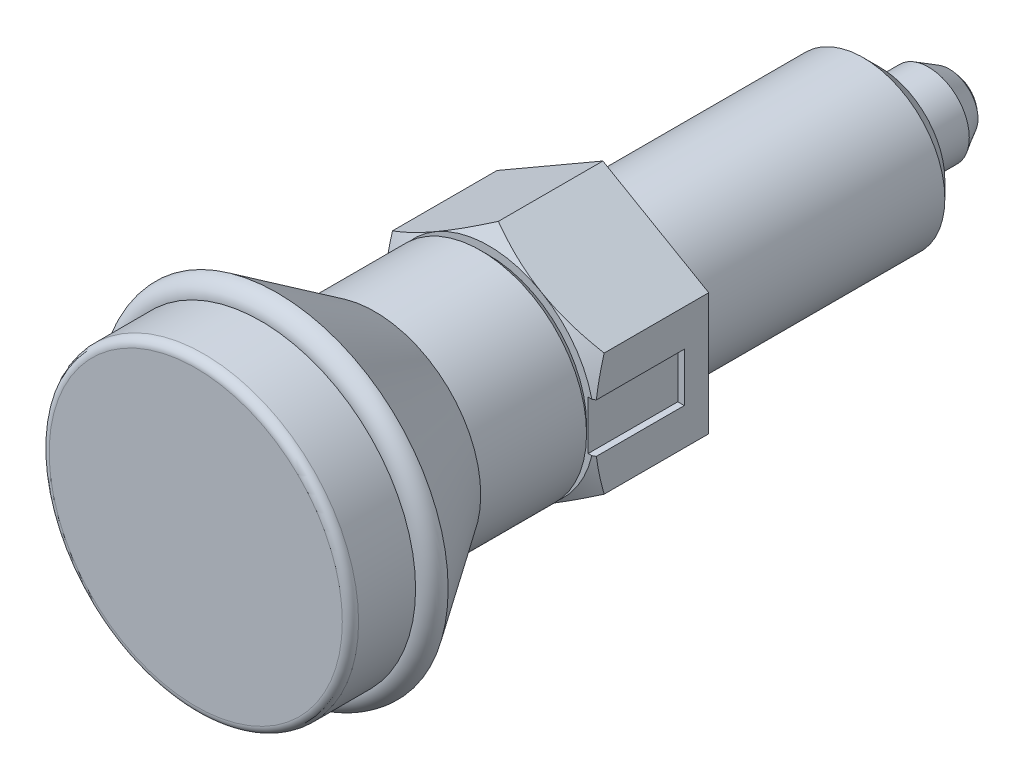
ISO-10303-21;
HEADER;
FILE_DESCRIPTION(('STEP AP214'),'2;1');
FILE_NAME('part.step','',(''),(''),'','','');
FILE_SCHEMA(('AUTOMOTIVE_DESIGN { 1 0 10303 214 1 1 1 1 }'));
ENDSEC;
DATA;
#1=APPLICATION_CONTEXT('core data for automotive mechanical design processes');
#2=APPLICATION_PROTOCOL_DEFINITION('international standard','automotive_design',2000,#1);
#3=PRODUCT_CONTEXT('',#1,'mechanical');
#4=PRODUCT('Part','Part','',(#3));
#5=PRODUCT_RELATED_PRODUCT_CATEGORY('part','',(#4));
#6=PRODUCT_DEFINITION_FORMATION('','',#4);
#7=PRODUCT_DEFINITION_CONTEXT('part definition',#1,'design');
#8=PRODUCT_DEFINITION('design','',#6,#7);
#9=PRODUCT_DEFINITION_SHAPE('','',#8);
#10=(LENGTH_UNIT() NAMED_UNIT(*) SI_UNIT(.MILLI.,.METRE.));
#11=(NAMED_UNIT(*) PLANE_ANGLE_UNIT() SI_UNIT($,.RADIAN.));
#12=(NAMED_UNIT(*) SI_UNIT($,.STERADIAN.) SOLID_ANGLE_UNIT());
#13=UNCERTAINTY_MEASURE_WITH_UNIT(LENGTH_MEASURE(1.E-05),#10,'distance_accuracy_value','');
#14=(GEOMETRIC_REPRESENTATION_CONTEXT(3) GLOBAL_UNCERTAINTY_ASSIGNED_CONTEXT((#13)) GLOBAL_UNIT_ASSIGNED_CONTEXT((#10,
#11,#12)) REPRESENTATION_CONTEXT('',''));
#15=CARTESIAN_POINT('',(0.,0.,0.));
#16=DIRECTION('',(0.,0.,1.));
#17=DIRECTION('',(1.,0.,0.));
#18=AXIS2_PLACEMENT_3D('',#15,#16,#17);
#19=CARTESIAN_POINT('',(2.59480249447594E-10,-1.4980960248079E-10,7.));
#20=DIRECTION('',(-3.7068607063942E-11,2.14013717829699E-11,-1.));
#21=DIRECTION('',(-1.,0.,3.7068607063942E-11));
#22=AXIS2_PLACEMENT_3D('',#19,#20,#21);
#23=CONICAL_SURFACE('',#22,6.49999999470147,1.0471975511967);
#24=CARTESIAN_POINT('',(6.50000000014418,-9.95291698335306,3.8895764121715));
#25=CARTESIAN_POINT('',(6.50000000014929,-9.66753022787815,4.02749105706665));
#26=CARTESIAN_POINT('',(6.50000000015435,-9.38146872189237,4.16403471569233));
#27=CARTESIAN_POINT('',(6.50000000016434,-8.80763137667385,4.43359663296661));
#28=CARTESIAN_POINT('',(6.50000000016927,-8.51985525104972,4.56661428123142));
#29=CARTESIAN_POINT('',(6.500000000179,-7.94066929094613,4.82904149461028));
#30=CARTESIAN_POINT('',(6.5000000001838,-7.64924808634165,4.95842605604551));
#31=CARTESIAN_POINT('',(6.50000000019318,-7.06401043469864,5.21163779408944));
#32=CARTESIAN_POINT('',(6.50000000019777,-6.77019411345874,5.33546526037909));
#33=CARTESIAN_POINT('',(6.50000000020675,-6.17605150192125,5.57755519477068));
#34=CARTESIAN_POINT('',(6.50000000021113,-5.87568957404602,5.69573067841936));
#35=CARTESIAN_POINT('',(6.50000000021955,-5.27142269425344,5.92282610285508));
#36=CARTESIAN_POINT('',(6.50000000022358,-4.96751735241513,6.03174501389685));
#37=CARTESIAN_POINT('',(6.50000000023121,-4.35630541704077,6.23740097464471));
#38=CARTESIAN_POINT('',(6.5000000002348,-4.04900762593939,6.33416392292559));
#39=CARTESIAN_POINT('',(6.5000000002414,-3.4300402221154,6.51236428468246));
#40=CARTESIAN_POINT('',(6.50000000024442,-3.11837202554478,6.59380654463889));
#41=CARTESIAN_POINT('',(6.50000000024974,-2.49046594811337,6.73741591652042));
#42=CARTESIAN_POINT('',(6.50000000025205,-2.17422687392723,6.79957789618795));
#43=CARTESIAN_POINT('',(6.50000000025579,-1.53789167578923,6.90042577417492));
#44=CARTESIAN_POINT('',(6.50000000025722,-1.21779554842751,6.93911165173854));
#45=CARTESIAN_POINT('',(6.50000000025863,-0.737141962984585,6.9770534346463));
#46=CARTESIAN_POINT('',(6.50000000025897,-0.577336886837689,6.98635478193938));
#47=CARTESIAN_POINT('',(6.50000000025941,-0.25746890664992,6.99818590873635));
#48=CARTESIAN_POINT('',(6.5000000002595,-0.0974060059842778,7.00071577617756));
#49=CARTESIAN_POINT('',(6.50000000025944,0.222635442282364,6.99893598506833));
#50=CARTESIAN_POINT('',(6.50000000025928,0.382614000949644,6.99462824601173));
#51=CARTESIAN_POINT('',(6.50000000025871,0.702250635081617,6.97928241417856));
#52=CARTESIAN_POINT('',(6.5000000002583,0.861908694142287,6.96824398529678));
#53=CARTESIAN_POINT('',(6.50000000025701,1.24887053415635,6.93356312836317));
#54=CARTESIAN_POINT('',(6.50000000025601,1.47587694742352,6.90654811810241));
#55=CARTESIAN_POINT('',(6.50000000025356,1.92815030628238,6.84041010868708));
#56=CARTESIAN_POINT('',(6.50000000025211,2.15341675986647,6.80128380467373));
#57=CARTESIAN_POINT('',(6.50000000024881,2.60202427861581,6.7123108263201));
#58=CARTESIAN_POINT('',(6.50000000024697,2.82536331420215,6.66245401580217));
#59=CARTESIAN_POINT('',(6.50000000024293,3.26974354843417,6.55354123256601));
#60=CARTESIAN_POINT('',(6.50000000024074,3.49078496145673,6.49448612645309));
#61=CARTESIAN_POINT('',(6.50000000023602,3.93601414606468,6.36704588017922));
#62=CARTESIAN_POINT('',(6.50000000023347,4.1601462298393,6.29846752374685));
#63=CARTESIAN_POINT('',(6.50000000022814,4.60604131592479,6.15453487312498));
#64=CARTESIAN_POINT('',(6.50000000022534,4.82780583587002,6.07918525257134));
#65=CARTESIAN_POINT('',(6.50000000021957,5.26807593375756,5.92326649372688));
#66=CARTESIAN_POINT('',(6.50000000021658,5.48659282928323,5.84272912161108));
#67=CARTESIAN_POINT('',(6.50000000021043,5.92193123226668,5.67692729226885));
#68=CARTESIAN_POINT('',(6.50000000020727,6.13875201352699,5.59166092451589));
#69=CARTESIAN_POINT('',(6.50000000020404,6.3547851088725,5.50449786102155));
#70=B_SPLINE_CURVE_WITH_KNOTS('',3,(#24,#25,#26,#27,#28,#29,#30,#31,#32,#33,#34,#35,#36,#37,#38,
#39,#40,#41,#42,#43,#44,#45,#46,#47,#48,#49,#50,#51,#52,#53,#54,#55,#56,#57,#58,#59,#60,#61,#62,
#63,#64,#65,#66,#67,#68,#69),.UNSPECIFIED.,.F.,.F.,(4,2,2,2,2,2,2,2,2,2,2,2,2,2,2,2,2,2,2,2,2,2,
4),(0.,0.950904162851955,1.90197187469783,2.85848216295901,3.81494253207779,4.78314526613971,
5.75145556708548,6.71766655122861,7.68357137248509,8.6497330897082,9.61589566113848,
10.0960003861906,10.5760988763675,11.0560626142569,11.5360503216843,12.221493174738,
12.9071232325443,13.5934038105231,14.2796197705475,14.9826563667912,15.6852113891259,
16.3838119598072,17.0826968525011),.UNSPECIFIED.);
#71=CARTESIAN_POINT('',(6.50000000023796,-3.75277674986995,6.41944341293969));
#72=VERTEX_POINT('',#71);
#73=CARTESIAN_POINT('',(6.50000000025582,-1.5000000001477,6.90137007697));
#74=VERTEX_POINT('',#73);
#75=EDGE_CURVE('E302',#72,#74,#70,.T.);
#76=ORIENTED_EDGE('',*,*,#75,.T.);
#77=CARTESIAN_POINT('',(7.59395940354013,-1.50000000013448,6.28368961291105));
#78=CARTESIAN_POINT('',(7.39727569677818,-1.50000000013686,6.39508777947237));
#79=CARTESIAN_POINT('',(7.20052625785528,-1.50000000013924,6.50637013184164));
#80=CARTESIAN_POINT('',(6.80685119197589,-1.500000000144,6.72862064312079));
#81=CARTESIAN_POINT('',(6.60992556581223,-1.50000000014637,6.83958880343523));
#82=CARTESIAN_POINT('',(6.21585121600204,-1.50000000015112,7.06112960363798));
#83=CARTESIAN_POINT('',(6.01870249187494,-1.50000000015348,7.17170224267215));
#84=CARTESIAN_POINT('',(5.62410400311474,-1.5000000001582,7.39231100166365));
#85=CARTESIAN_POINT('',(5.42665423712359,-1.50000000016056,7.50234711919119));
#86=CARTESIAN_POINT('',(5.22901565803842,-1.50000000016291,7.61204409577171));
#87=B_SPLINE_CURVE_WITH_KNOTS('',3,(#77,#78,#79,#80,#81,#82,#83,#84,#85,#86),.UNSPECIFIED.,.F.,
.F.,(4,2,2,2,4),(0.,0.678119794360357,1.35623655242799,2.0343547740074,2.71247606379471),.UNSPECIFIED.);
#88=CARTESIAN_POINT('',(6.32455531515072,-1.50000000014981,6.99999999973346));
#89=VERTEX_POINT('',#88);
#90=EDGE_CURVE('E146',#74,#89,#87,.T.);
#91=ORIENTED_EDGE('',*,*,#90,.T.);
#92=CARTESIAN_POINT('',(2.59480249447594E-10,-1.4980960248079E-10,7.));
#93=DIRECTION('',(3.7068607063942E-11,-2.14013717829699E-11,1.));
#94=DIRECTION('',(1.,0.,-3.7068607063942E-11));
#95=AXIS2_PLACEMENT_3D('',#92,#93,#94);
#96=CIRCLE('',#95,6.49999999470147);
#97=CARTESIAN_POINT('',(3.25000000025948,-5.62916512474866,6.99999999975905));
#98=VERTEX_POINT('',#97);
#99=EDGE_CURVE('E408',#98,#89,#96,.T.);
#100=ORIENTED_EDGE('',*,*,#99,.F.);
#101=CARTESIAN_POINT('',(-0.000199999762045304,-7.50566896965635,6.41937674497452));
#102=CARTESIAN_POINT('',(0.142677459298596,-7.4231786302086,6.46699557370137));
#103=CARTESIAN_POINT('',(0.28608763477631,-7.34038072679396,6.5124532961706));
#104=CARTESIAN_POINT('',(0.574072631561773,-7.17411251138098,6.59845131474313));
#105=CARTESIAN_POINT('',(0.718647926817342,-7.09064192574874,6.63898948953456));
#106=CARTESIAN_POINT('',(1.1546886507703,-6.83889369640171,6.75242899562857));
#107=CARTESIAN_POINT('',(1.44787528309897,-6.66962231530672,6.81695218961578));
#108=CARTESIAN_POINT('',(1.88662374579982,-6.41631077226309,6.89261341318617));
#109=CARTESIAN_POINT('',(2.03087463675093,-6.33302748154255,6.9141671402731));
#110=CARTESIAN_POINT('',(2.32002821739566,-6.16608458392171,6.95030968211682));
#111=CARTESIAN_POINT('',(2.464930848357,-6.08242501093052,6.96489911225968));
#112=CARTESIAN_POINT('',(2.75498777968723,-5.91496056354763,6.98674124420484));
#113=CARTESIAN_POINT('',(2.90014160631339,-5.83115596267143,6.99400227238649));
#114=CARTESIAN_POINT('',(3.19057533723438,-5.66347396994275,7.00103969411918));
#115=CARTESIAN_POINT('',(3.33585523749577,-5.57959658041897,7.0008163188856));
#116=CARTESIAN_POINT('',(3.73387594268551,-5.34979921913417,6.9899165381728));
#117=CARTESIAN_POINT('',(3.98648646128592,-5.20395446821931,6.97161817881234));
#118=CARTESIAN_POINT('',(4.4900296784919,-4.91323365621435,6.91359365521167));
#119=CARTESIAN_POINT('',(4.74096060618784,-4.7683586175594,6.8738476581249));
#120=CARTESIAN_POINT('',(5.24551722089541,-4.47705272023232,6.77449409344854));
#121=CARTESIAN_POINT('',(5.49907924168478,-4.33065861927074,6.71446557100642));
#122=CARTESIAN_POINT('',(6.00242193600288,-4.04005357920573,6.57822500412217));
#123=CARTESIAN_POINT('',(6.25220905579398,-3.89583891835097,6.50204496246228));
#124=CARTESIAN_POINT('',(6.50020000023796,-3.75266127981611,6.41937674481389));
#125=B_SPLINE_CURVE_WITH_KNOTS('',3,(#101,#102,#103,#104,#105,#106,#107,#108,#109,#110,#111,
#112,#113,#114,#115,#116,#117,#118,#119,#120,#121,#122,#123,#124),.UNSPECIFIED.,.F.,.F.,(4,2,2,
2,2,2,2,2,2,2,2,4),(0.,0.51510505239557,1.03043143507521,2.06322554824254,2.56697389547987,
3.07067772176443,3.57380860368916,4.07692394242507,4.9527935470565,5.82947446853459,
6.7255991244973,7.61996451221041),.UNSPECIFIED.);
#126=EDGE_CURVE('E294',#98,#72,#125,.T.);
#127=ORIENTED_EDGE('',*,*,#126,.T.);
#128=EDGE_LOOP('',(#76,#91,#100,#127));
#129=FACE_BOUND('',#128,.T.);
#130=ADVANCED_FACE('F14',(#129),#23,.T.);
#131=CARTESIAN_POINT('',(6.32455531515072,1.49999999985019,6.99999999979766));
#132=VERTEX_POINT('',#131);
#133=CARTESIAN_POINT('',(3.25000000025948,5.62916512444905,7.));
#134=VERTEX_POINT('',#133);
#135=EDGE_CURVE('E411',#132,#134,#96,.T.);
#136=ORIENTED_EDGE('',*,*,#135,.F.);
#137=CARTESIAN_POINT('',(5.22901565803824,1.49999999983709,7.61204409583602));
#138=CARTESIAN_POINT('',(5.4266542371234,1.49999999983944,7.50234711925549));
#139=CARTESIAN_POINT('',(5.62410400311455,1.49999999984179,7.39231100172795));
#140=CARTESIAN_POINT('',(6.01870249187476,1.49999999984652,7.17170224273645));
#141=CARTESIAN_POINT('',(6.21585121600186,1.49999999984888,7.06112960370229));
#142=CARTESIAN_POINT('',(6.60992556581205,1.49999999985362,6.83958880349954));
#143=CARTESIAN_POINT('',(6.80685119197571,1.499999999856,6.7286206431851));
#144=CARTESIAN_POINT('',(7.2005262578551,1.49999999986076,6.50637013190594));
#145=CARTESIAN_POINT('',(7.397275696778,1.49999999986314,6.39508777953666));
#146=CARTESIAN_POINT('',(7.59395940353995,1.49999999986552,6.28368961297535));
#147=B_SPLINE_CURVE_WITH_KNOTS('',3,(#137,#138,#139,#140,#141,#142,#143,#144,#145,#146),
.UNSPECIFIED.,.F.,.F.,(4,2,2,2,4),(0.,0.678121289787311,1.35623951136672,2.03435626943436,
2.71247606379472),.UNSPECIFIED.);
#148=CARTESIAN_POINT('',(6.50000000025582,1.4999999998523,6.90137007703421));
#149=VERTEX_POINT('',#148);
#150=EDGE_CURVE('E154',#132,#149,#147,.T.);
#151=ORIENTED_EDGE('',*,*,#150,.T.);
#152=CARTESIAN_POINT('',(6.50000000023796,3.75277674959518,6.41944341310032));
#153=VERTEX_POINT('',#152);
#154=EDGE_CURVE('E270',#149,#153,#70,.T.);
#155=ORIENTED_EDGE('',*,*,#154,.T.);
#156=CARTESIAN_POINT('',(6.50020000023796,3.75266127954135,6.41937674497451));
#157=CARTESIAN_POINT('',(6.35732254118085,3.83515161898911,6.46699557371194));
#158=CARTESIAN_POINT('',(6.21391236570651,3.91794952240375,6.5124532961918));
#159=CARTESIAN_POINT('',(5.92592736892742,4.08421773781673,6.59845131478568));
#160=CARTESIAN_POINT('',(5.78135207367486,4.16768832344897,6.63898948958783));
#161=CARTESIAN_POINT('',(5.3453113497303,4.41943655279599,6.75242899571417));
#162=CARTESIAN_POINT('',(5.05212471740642,4.58870793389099,6.81695218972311));
#163=CARTESIAN_POINT('',(4.61337625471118,4.84201947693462,6.89261341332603));
#164=CARTESIAN_POINT('',(4.46912536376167,4.92530276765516,6.91416714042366));
#165=CARTESIAN_POINT('',(4.17997178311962,5.09224566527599,6.95030968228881));
#166=CARTESIAN_POINT('',(4.03506915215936,5.17590523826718,6.96489911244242));
#167=CARTESIAN_POINT('',(3.74501222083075,5.34336968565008,6.98674124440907));
#168=CARTESIAN_POINT('',(3.59985839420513,5.42717428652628,6.99400227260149));
#169=CARTESIAN_POINT('',(3.30942466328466,5.59485627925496,7.00103969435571));
#170=CARTESIAN_POINT('',(3.16414476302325,5.67873366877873,7.00081631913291));
#171=CARTESIAN_POINT('',(2.7661240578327,5.90853103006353,6.98991653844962));
#172=CARTESIAN_POINT('',(2.51351353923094,6.05437578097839,6.97161817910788));
#173=CARTESIAN_POINT('',(2.00997032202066,6.34509659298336,6.91359365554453));
#174=CARTESIAN_POINT('',(1.75903939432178,6.48997163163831,6.87384765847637));
#175=CARTESIAN_POINT('',(1.25448277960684,6.78127752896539,6.77449409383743));
#176=CARTESIAN_POINT('',(1.00092075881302,6.92767162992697,6.7144655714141));
#177=CARTESIAN_POINT('',(0.497578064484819,7.21827666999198,6.57822500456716));
#178=CARTESIAN_POINT('',(0.247790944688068,7.36249133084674,6.5020449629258));
#179=CARTESIAN_POINT('',(-0.000199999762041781,7.5056689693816,6.41937674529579));
#180=B_SPLINE_CURVE_WITH_KNOTS('',3,(#156,#157,#158,#159,#160,#161,#162,#163,#164,#165,#166,
#167,#168,#169,#170,#171,#172,#173,#174,#175,#176,#177,#178,#179),.UNSPECIFIED.,.F.,.F.,(4,2,2,
2,2,2,2,2,2,2,2,4),(0.,0.515105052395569,1.03043143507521,2.06322554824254,2.56697389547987,
3.07067772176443,3.57380860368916,4.07692394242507,4.95279354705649,5.82947446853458,
6.7255991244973,7.61996451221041),.UNSPECIFIED.);
#181=EDGE_CURVE('E269',#153,#134,#180,.T.);
#182=ORIENTED_EDGE('',*,*,#181,.T.);
#183=EDGE_LOOP('',(#136,#151,#155,#182));
#184=FACE_BOUND('',#183,.T.);
#185=ADVANCED_FACE('F372',(#184),#23,.T.);
#186=CARTESIAN_POINT('',(2.59480249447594E-10,6.49999999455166,7.00000000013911));
#187=DIRECTION('',(3.7068607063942E-11,-2.14013717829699E-11,1.));
#188=DIRECTION('',(1.,0.,-3.7068607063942E-11));
#189=AXIS2_PLACEMENT_3D('',#186,#187,#188);
#190=PLANE('',#189);
#191=CARTESIAN_POINT('',(2.59480249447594E-10,-1.4980960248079E-10,7.));
#192=DIRECTION('',(3.7068607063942E-11,-2.14013717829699E-11,1.));
#193=DIRECTION('',(1.,0.,-3.7068607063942E-11));
#194=AXIS2_PLACEMENT_3D('',#191,#192,#193);
#195=CIRCLE('',#194,6.);
#196=CARTESIAN_POINT('',(6.00000000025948,-1.4980960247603E-10,6.99999999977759));
#197=VERTEX_POINT('',#196);
#198=EDGE_CURVE('E421',#197,#197,#195,.T.);
#199=ORIENTED_EDGE('',*,*,#198,.F.);
#200=EDGE_LOOP('',(#199));
#201=FACE_BOUND('',#200,.T.);
#202=ORIENTED_EDGE('',*,*,#99,.T.);
#203=DIRECTION('',(1.,0.,-3.7068607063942E-11));
#204=VECTOR('',#203,1.);
#205=CARTESIAN_POINT('',(6.10000000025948,-1.50000000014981,6.99999999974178));
#206=LINE('',#205,#204);
#207=CARTESIAN_POINT('',(6.10000000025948,-1.50000000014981,6.99999999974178));
#208=VERTEX_POINT('',#207);
#209=EDGE_CURVE('E155',#208,#89,#206,.T.);
#210=ORIENTED_EDGE('',*,*,#209,.F.);
#211=DIRECTION('',(0.,1.,2.14013717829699E-11));
#212=VECTOR('',#211,1.);
#213=CARTESIAN_POINT('',(6.10000000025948,-1.50000000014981,6.99999999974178));
#214=LINE('',#213,#212);
#215=CARTESIAN_POINT('',(6.10000000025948,1.49999999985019,6.99999999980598));
#216=VERTEX_POINT('',#215);
#217=EDGE_CURVE('E164',#208,#216,#214,.T.);
#218=ORIENTED_EDGE('',*,*,#217,.T.);
#219=DIRECTION('',(1.,0.,-3.7068607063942E-11));
#220=VECTOR('',#219,1.);
#221=CARTESIAN_POINT('',(6.10000000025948,1.49999999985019,6.99999999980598));
#222=LINE('',#221,#220);
#223=EDGE_CURVE('E171',#216,#132,#222,.T.);
#224=ORIENTED_EDGE('',*,*,#223,.T.);
#225=ORIENTED_EDGE('',*,*,#135,.T.);
#226=CARTESIAN_POINT('',(-3.24999999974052,5.62916512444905,7.00000000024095));
#227=VERTEX_POINT('',#226);
#228=EDGE_CURVE('E416',#134,#227,#96,.T.);
#229=ORIENTED_EDGE('',*,*,#228,.T.);
#230=CARTESIAN_POINT('',(-6.32455531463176,1.49999999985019,7.00000000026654));
#231=VERTEX_POINT('',#230);
#232=EDGE_CURVE('E410',#227,#231,#96,.T.);
#233=ORIENTED_EDGE('',*,*,#232,.T.);
#234=DIRECTION('',(-1.,0.,3.7068607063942E-11));
#235=VECTOR('',#234,1.);
#236=CARTESIAN_POINT('',(-6.09999999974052,1.49999999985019,7.00000000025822));
#237=LINE('',#236,#235);
#238=CARTESIAN_POINT('',(-6.09999999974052,1.49999999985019,7.00000000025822));
#239=VERTEX_POINT('',#238);
#240=EDGE_CURVE('E451',#239,#231,#237,.T.);
#241=ORIENTED_EDGE('',*,*,#240,.F.);
#242=DIRECTION('',(0.,1.,2.14013717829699E-11));
#243=VECTOR('',#242,1.);
#244=CARTESIAN_POINT('',(-6.09999999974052,-1.50000000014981,7.00000000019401));
#245=LINE('',#244,#243);
#246=CARTESIAN_POINT('',(-6.09999999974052,-1.50000000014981,7.00000000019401));
#247=VERTEX_POINT('',#246);
#248=EDGE_CURVE('E462',#247,#239,#245,.T.);
#249=ORIENTED_EDGE('',*,*,#248,.F.);
#250=DIRECTION('',(-1.,0.,3.7068607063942E-11));
#251=VECTOR('',#250,1.);
#252=CARTESIAN_POINT('',(-6.09999999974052,-1.50000000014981,7.00000000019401));
#253=LINE('',#252,#251);
#254=CARTESIAN_POINT('',(-6.32455531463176,-1.50000000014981,7.00000000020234));
#255=VERTEX_POINT('',#254);
#256=EDGE_CURVE('E468',#247,#255,#253,.T.);
#257=ORIENTED_EDGE('',*,*,#256,.T.);
#258=CARTESIAN_POINT('',(-3.24999999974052,-5.62916512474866,7.));
#259=VERTEX_POINT('',#258);
#260=EDGE_CURVE('E407',#255,#259,#96,.T.);
#261=ORIENTED_EDGE('',*,*,#260,.T.);
#262=EDGE_CURVE('E402',#259,#98,#96,.T.);
#263=ORIENTED_EDGE('',*,*,#262,.T.);
#264=EDGE_LOOP('',(#202,#210,#218,#224,#225,#229,#233,#241,#249,#257,#261,#263));
#265=FACE_BOUND('',#264,.T.);
#266=ADVANCED_FACE('F286',(#201,#265),#190,.T.);
#267=CARTESIAN_POINT('',(6.50000000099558,3.75277674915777,26.8578280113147));
#268=DIRECTION('',(1.,0.,-3.7068607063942E-11));
#269=DIRECTION('',(0.,1.,2.14013717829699E-11));
#270=AXIS2_PLACEMENT_3D('',#267,#268,#269);
#271=PLANE('',#270);
#272=DIRECTION('',(0.,-1.,-2.14013717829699E-11));
#273=VECTOR('',#272,1.);
#274=CARTESIAN_POINT('',(6.5000000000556,1.4999999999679,1.49999999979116));
#275=LINE('',#274,#273);
#276=CARTESIAN_POINT('',(6.5000000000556,1.4999999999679,1.49999999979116));
#277=VERTEX_POINT('',#276);
#278=CARTESIAN_POINT('',(6.5000000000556,-1.5000000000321,1.49999999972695));
#279=VERTEX_POINT('',#278);
#280=EDGE_CURVE('E29',#277,#279,#275,.T.);
#281=ORIENTED_EDGE('',*,*,#280,.T.);
#282=DIRECTION('',(3.7068607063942E-11,-2.14014112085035E-11,1.));
#283=VECTOR('',#282,1.);
#284=CARTESIAN_POINT('',(6.5000000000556,-1.5000000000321,1.49999999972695));
#285=LINE('',#284,#283);
#286=EDGE_CURVE('E142',#279,#74,#285,.T.);
#287=ORIENTED_EDGE('',*,*,#286,.T.);
#288=ORIENTED_EDGE('',*,*,#75,.F.);
#289=DIRECTION('',(-3.7068607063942E-11,2.14013717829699E-11,-1.));
#290=VECTOR('',#289,1.);
#291=CARTESIAN_POINT('',(6.50000000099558,-3.75277675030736,26.8578280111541));
#292=LINE('',#291,#290);
#293=CARTESIAN_POINT('',(6.5,-3.75277674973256,-3.21260379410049E-10));
#294=VERTEX_POINT('',#293);
#295=EDGE_CURVE('E239',#72,#294,#292,.T.);
#296=ORIENTED_EDGE('',*,*,#295,.T.);
#297=DIRECTION('',(0.,-1.,-2.14013717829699E-11));
#298=VECTOR('',#297,1.);
#299=CARTESIAN_POINT('',(6.5,3.75277674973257,-1.606319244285E-10));
#300=LINE('',#299,#298);
#301=CARTESIAN_POINT('',(6.50000000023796,3.75277674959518,-1.606319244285E-10));
#302=VERTEX_POINT('',#301);
#303=EDGE_CURVE('E244',#302,#294,#300,.T.);
#304=ORIENTED_EDGE('',*,*,#303,.F.);
#305=DIRECTION('',(-3.7068607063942E-11,2.14013717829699E-11,-1.));
#306=VECTOR('',#305,1.);
#307=CARTESIAN_POINT('',(6.50000000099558,3.75277674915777,26.8578280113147));
#308=LINE('',#307,#306);
#309=EDGE_CURVE('E243',#153,#302,#308,.T.);
#310=ORIENTED_EDGE('',*,*,#309,.F.);
#311=ORIENTED_EDGE('',*,*,#154,.F.);
#312=DIRECTION('',(-3.7068607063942E-11,2.14013717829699E-11,-1.));
#313=VECTOR('',#312,1.);
#314=CARTESIAN_POINT('',(6.50000000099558,1.49999999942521,26.8578280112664));
#315=LINE('',#314,#313);
#316=EDGE_CURVE('E9',#149,#277,#315,.T.);
#317=ORIENTED_EDGE('',*,*,#316,.T.);
#318=EDGE_LOOP('',(#281,#287,#288,#296,#304,#310,#311,#317));
#319=FACE_BOUND('',#318,.T.);
#320=ADVANCED_FACE('F157',(#319),#271,.T.);
#321=CARTESIAN_POINT('',(0.,7.50555349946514,6.41944341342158));
#322=VERTEX_POINT('',#321);
#323=EDGE_CURVE('E251',#134,#322,#180,.T.);
#324=ORIENTED_EDGE('',*,*,#323,.T.);
#325=CARTESIAN_POINT('',(0.000200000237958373,7.5056689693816,6.41937674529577));
#326=CARTESIAN_POINT('',(-0.14267745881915,7.42317862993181,6.46699557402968));
#327=CARTESIAN_POINT('',(-0.286087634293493,7.34038072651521,6.51245329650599));
#328=CARTESIAN_POINT('',(-0.574072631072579,7.17411251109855,6.59845131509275));
#329=CARTESIAN_POINT('',(-0.718647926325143,7.09064192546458,6.63898948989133));
#330=CARTESIAN_POINT('',(-1.1546886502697,6.8388936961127,6.7524289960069));
#331=CARTESIAN_POINT('',(-1.44787528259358,6.66962231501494,6.8169521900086));
#332=CARTESIAN_POINT('',(-1.88662374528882,6.41631077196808,6.89261341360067));
#333=CARTESIAN_POINT('',(-2.03087463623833,6.33302748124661,6.91416714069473));
#334=CARTESIAN_POINT('',(-2.32002821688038,6.16608458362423,6.95030968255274));
#335=CARTESIAN_POINT('',(-2.46493084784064,6.08242501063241,6.96489911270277));
#336=CARTESIAN_POINT('',(-2.75498777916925,5.91496056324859,6.98674124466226));
#337=CARTESIAN_POINT('',(-2.90014160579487,5.83115596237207,6.99400227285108));
#338=CARTESIAN_POINT('',(-3.19057533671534,5.66347396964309,7.00103969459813));
#339=CARTESIAN_POINT('',(-3.33585523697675,5.57959658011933,7.00081631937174));
#340=CARTESIAN_POINT('',(-3.7338759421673,5.34979921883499,6.98991653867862));
#341=CARTESIAN_POINT('',(-3.98648646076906,5.20395446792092,6.97161817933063));
#342=CARTESIAN_POINT('',(-4.49002967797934,4.91323365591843,6.91359365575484));
#343=CARTESIAN_POINT('',(-4.74096060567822,4.76835861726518,6.87384765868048));
#344=CARTESIAN_POINT('',(-5.24551722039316,4.47705271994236,6.77449409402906));
#345=CARTESIAN_POINT('',(-5.49907924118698,4.33065861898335,6.71446557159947));
#346=CARTESIAN_POINT('',(-6.00242193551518,4.04005357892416,6.57822500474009));
#347=CARTESIAN_POINT('',(-6.25220905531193,3.89583891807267,6.50204496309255));
#348=CARTESIAN_POINT('',(-6.50019999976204,3.75266127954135,6.41937674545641));
#349=B_SPLINE_CURVE_WITH_KNOTS('',3,(#325,#326,#327,#328,#329,#330,#331,#332,#333,#334,#335,
#336,#337,#338,#339,#340,#341,#342,#343,#344,#345,#346,#347,#348),.UNSPECIFIED.,.F.,.F.,(4,2,2,
2,2,2,2,2,2,2,2,4),(0.,0.515105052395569,1.03043143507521,2.06322554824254,2.56697389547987,
3.07067772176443,3.57380860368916,4.07692394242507,4.9527935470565,5.82947446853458,
6.7255991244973,7.61996451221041),.UNSPECIFIED.);
#350=EDGE_CURVE('E495',#322,#227,#349,.T.);
#351=ORIENTED_EDGE('',*,*,#350,.T.);
#352=ORIENTED_EDGE('',*,*,#228,.F.);
#353=EDGE_LOOP('',(#324,#351,#352));
#354=FACE_BOUND('',#353,.T.);
#355=ADVANCED_FACE('F189',(#354),#23,.T.);
#356=CARTESIAN_POINT('',(-5.2290156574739,1.49999999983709,7.61204409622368));
#357=CARTESIAN_POINT('',(-5.4266542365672,1.49999999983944,7.50234711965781));
#358=CARTESIAN_POINT('',(-5.62410400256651,1.49999999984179,7.39231100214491));
#359=CARTESIAN_POINT('',(-6.01870249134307,1.49999999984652,7.17170224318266));
#360=CARTESIAN_POINT('',(-6.21585121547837,1.49999999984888,7.06112960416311));
#361=CARTESIAN_POINT('',(-6.60992556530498,1.49999999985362,6.83958880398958));
#362=CARTESIAN_POINT('',(-6.80685119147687,1.499999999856,6.72862064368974));
#363=CARTESIAN_POINT('',(-7.20052625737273,1.49999999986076,6.50637013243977));
#364=CARTESIAN_POINT('',(-7.39727569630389,1.49999999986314,6.39508778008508));
#365=CARTESIAN_POINT('',(-7.59395940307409,1.49999999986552,6.28368961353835));
#366=B_SPLINE_CURVE_WITH_KNOTS('',3,(#356,#357,#358,#359,#360,#361,#362,#363,#364,#365),
.UNSPECIFIED.,.F.,.F.,(4,2,2,2,4),(0.,0.678121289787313,1.35623951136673,2.03435626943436,
2.71247606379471),.UNSPECIFIED.);
#367=CARTESIAN_POINT('',(-6.49999999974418,1.4999999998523,6.9013700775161));
#368=VERTEX_POINT('',#367);
#369=EDGE_CURVE('E217',#231,#368,#366,.T.);
#370=ORIENTED_EDGE('',*,*,#369,.F.);
#371=ORIENTED_EDGE('',*,*,#232,.F.);
#372=CARTESIAN_POINT('',(-6.49999999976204,3.75277674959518,6.41944341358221));
#373=VERTEX_POINT('',#372);
#374=EDGE_CURVE('E318',#227,#373,#349,.T.);
#375=ORIENTED_EDGE('',*,*,#374,.T.);
#376=CARTESIAN_POINT('',(-6.49999999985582,-9.95291698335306,3.88957641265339));
#377=CARTESIAN_POINT('',(-6.49999999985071,-9.66753022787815,4.02749105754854));
#378=CARTESIAN_POINT('',(-6.49999999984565,-9.38146872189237,4.16403471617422));
#379=CARTESIAN_POINT('',(-6.49999999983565,-8.80763137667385,4.4335966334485));
#380=CARTESIAN_POINT('',(-6.49999999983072,-8.51985525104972,4.56661428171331));
#381=CARTESIAN_POINT('',(-6.499999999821,-7.94066929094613,4.82904149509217));
#382=CARTESIAN_POINT('',(-6.4999999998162,-7.64924808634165,4.95842605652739));
#383=CARTESIAN_POINT('',(-6.49999999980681,-7.06401043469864,5.21163779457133));
#384=CARTESIAN_POINT('',(-6.49999999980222,-6.77019411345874,5.33546526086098));
#385=CARTESIAN_POINT('',(-6.49999999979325,-6.17605150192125,5.57755519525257));
#386=CARTESIAN_POINT('',(-6.49999999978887,-5.87568957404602,5.69573067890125));
#387=CARTESIAN_POINT('',(-6.49999999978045,-5.27142269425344,5.92282610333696));
#388=CARTESIAN_POINT('',(-6.49999999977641,-4.96751735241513,6.03174501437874));
#389=CARTESIAN_POINT('',(-6.49999999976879,-4.35630541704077,6.2374009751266));
#390=CARTESIAN_POINT('',(-6.4999999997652,-4.04900762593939,6.33416392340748));
#391=CARTESIAN_POINT('',(-6.4999999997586,-3.4300402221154,6.51236428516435));
#392=CARTESIAN_POINT('',(-6.49999999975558,-3.11837202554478,6.59380654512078));
#393=CARTESIAN_POINT('',(-6.49999999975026,-2.49046594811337,6.73741591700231));
#394=CARTESIAN_POINT('',(-6.49999999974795,-2.17422687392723,6.79957789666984));
#395=CARTESIAN_POINT('',(-6.49999999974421,-1.53789167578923,6.90042577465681));
#396=CARTESIAN_POINT('',(-6.49999999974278,-1.21779554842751,6.93911165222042));
#397=CARTESIAN_POINT('',(-6.49999999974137,-0.737141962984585,6.97705343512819));
#398=CARTESIAN_POINT('',(-6.49999999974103,-0.577336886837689,6.98635478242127));
#399=CARTESIAN_POINT('',(-6.49999999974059,-0.25746890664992,6.99818590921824));
#400=CARTESIAN_POINT('',(-6.49999999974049,-0.0974060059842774,7.00071577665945));
#401=CARTESIAN_POINT('',(-6.49999999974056,0.222635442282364,6.99893598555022));
#402=CARTESIAN_POINT('',(-6.49999999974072,0.382614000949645,6.99462824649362));
#403=CARTESIAN_POINT('',(-6.49999999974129,0.702250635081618,6.97928241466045));
#404=CARTESIAN_POINT('',(-6.4999999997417,0.861908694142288,6.96824398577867));
#405=CARTESIAN_POINT('',(-6.49999999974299,1.24887053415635,6.93356312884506));
#406=CARTESIAN_POINT('',(-6.49999999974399,1.47587694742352,6.9065481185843));
#407=CARTESIAN_POINT('',(-6.49999999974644,1.92815030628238,6.84041010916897));
#408=CARTESIAN_POINT('',(-6.49999999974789,2.15341675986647,6.80128380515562));
#409=CARTESIAN_POINT('',(-6.49999999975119,2.60202427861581,6.71231082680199));
#410=CARTESIAN_POINT('',(-6.49999999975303,2.82536331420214,6.66245401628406));
#411=CARTESIAN_POINT('',(-6.49999999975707,3.26974354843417,6.5535412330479));
#412=CARTESIAN_POINT('',(-6.49999999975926,3.49078496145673,6.49448612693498));
#413=CARTESIAN_POINT('',(-6.49999999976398,3.93601414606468,6.36704588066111));
#414=CARTESIAN_POINT('',(-6.49999999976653,4.1601462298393,6.29846752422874));
#415=CARTESIAN_POINT('',(-6.49999999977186,4.60604131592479,6.15453487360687));
#416=CARTESIAN_POINT('',(-6.49999999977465,4.82780583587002,6.07918525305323));
#417=CARTESIAN_POINT('',(-6.49999999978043,5.26807593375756,5.92326649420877));
#418=CARTESIAN_POINT('',(-6.49999999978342,5.48659282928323,5.84272912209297));
#419=CARTESIAN_POINT('',(-6.49999999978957,5.92193123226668,5.67692729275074));
#420=CARTESIAN_POINT('',(-6.49999999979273,6.13875201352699,5.59166092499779));
#421=CARTESIAN_POINT('',(-6.49999999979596,6.3547851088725,5.50449786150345));
#422=B_SPLINE_CURVE_WITH_KNOTS('',3,(#376,#377,#378,#379,#380,#381,#382,#383,#384,#385,#386,
#387,#388,#389,#390,#391,#392,#393,#394,#395,#396,#397,#398,#399,#400,#401,#402,#403,#404,#405,
#406,#407,#408,#409,#410,#411,#412,#413,#414,#415,#416,#417,#418,#419,#420,#421),.UNSPECIFIED.,
.F.,.F.,(4,2,2,2,2,2,2,2,2,2,2,2,2,2,2,2,2,2,2,2,2,2,4),(0.,0.950904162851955,1.90197187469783,
2.858482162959,3.81494253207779,4.78314526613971,5.75145556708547,6.7176665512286,
7.68357137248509,8.6497330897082,9.61589566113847,10.0960003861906,10.5760988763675,
11.0560626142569,11.5360503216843,12.221493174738,12.9071232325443,13.5934038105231,
14.2796197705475,14.9826563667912,15.6852113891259,16.3838119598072,17.0826968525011),.UNSPECIFIED.);
#423=EDGE_CURVE('E317',#373,#368,#422,.F.);
#424=ORIENTED_EDGE('',*,*,#423,.T.);
#425=EDGE_LOOP('',(#370,#371,#375,#424));
#426=FACE_BOUND('',#425,.T.);
#427=ADVANCED_FACE('F379',(#426),#23,.T.);
#428=CARTESIAN_POINT('',(-7.59395940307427,-1.50000000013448,6.28368961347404));
#429=CARTESIAN_POINT('',(-7.39727569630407,-1.50000000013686,6.39508778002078));
#430=CARTESIAN_POINT('',(-7.20052625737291,-1.50000000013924,6.50637013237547));
#431=CARTESIAN_POINT('',(-6.80685119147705,-1.500000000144,6.72862064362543));
#432=CARTESIAN_POINT('',(-6.60992556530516,-1.50000000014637,6.83958880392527));
#433=CARTESIAN_POINT('',(-6.21585121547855,-1.50000000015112,7.0611296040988));
#434=CARTESIAN_POINT('',(-6.01870249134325,-1.50000000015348,7.17170224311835));
#435=CARTESIAN_POINT('',(-5.62410400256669,-1.5000000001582,7.39231100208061));
#436=CARTESIAN_POINT('',(-5.42665423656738,-1.50000000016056,7.50234711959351));
#437=CARTESIAN_POINT('',(-5.22901565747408,-1.50000000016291,7.61204409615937));
#438=B_SPLINE_CURVE_WITH_KNOTS('',3,(#428,#429,#430,#431,#432,#433,#434,#435,#436,#437),
.UNSPECIFIED.,.F.,.F.,(4,2,2,2,4),(0.,0.678119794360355,1.35623655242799,2.0343547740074,
2.71247606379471),.UNSPECIFIED.);
#439=CARTESIAN_POINT('',(-6.49999999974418,-1.5000000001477,6.90137007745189));
#440=VERTEX_POINT('',#439);
#441=EDGE_CURVE('E225',#440,#255,#438,.T.);
#442=ORIENTED_EDGE('',*,*,#441,.F.);
#443=CARTESIAN_POINT('',(-6.49999999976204,-3.75277674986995,6.41944341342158));
#444=VERTEX_POINT('',#443);
#445=EDGE_CURVE('E311',#440,#444,#422,.F.);
#446=ORIENTED_EDGE('',*,*,#445,.T.);
#447=CARTESIAN_POINT('',(-6.50019999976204,-3.75266127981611,6.41937674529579));
#448=CARTESIAN_POINT('',(-6.3573225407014,-3.8351516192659,6.46699557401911));
#449=CARTESIAN_POINT('',(-6.21391236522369,-3.91794952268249,6.51245329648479));
#450=CARTESIAN_POINT('',(-5.92592736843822,-4.08421773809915,6.5984513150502));
#451=CARTESIAN_POINT('',(-5.78135207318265,-4.16768832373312,6.63898948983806));
#452=CARTESIAN_POINT('',(-5.34531134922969,-4.419436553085,6.7524289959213));
#453=CARTESIAN_POINT('',(-5.05212471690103,-4.58870793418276,6.81695218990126));
#454=CARTESIAN_POINT('',(-4.61337625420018,-4.84201947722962,6.89261341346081));
#455=CARTESIAN_POINT('',(-4.46912536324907,-4.92530276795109,6.91416714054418));
#456=CARTESIAN_POINT('',(-4.17997178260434,-5.09224566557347,6.95030968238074));
#457=CARTESIAN_POINT('',(-4.035069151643,-5.17590523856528,6.96489911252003));
#458=CARTESIAN_POINT('',(-3.74501222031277,-5.34336968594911,6.98674124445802));
#459=CARTESIAN_POINT('',(-3.59985839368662,-5.42717428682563,6.99400227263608));
#460=CARTESIAN_POINT('',(-3.30942466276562,-5.59485627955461,7.0010396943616));
#461=CARTESIAN_POINT('',(-3.16414476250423,-5.67873366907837,7.00081631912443));
#462=CARTESIAN_POINT('',(-2.76612405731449,-5.90853103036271,6.98991653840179));
#463=CARTESIAN_POINT('',(-2.51351353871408,-6.05437578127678,6.97161817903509));
#464=CARTESIAN_POINT('',(-2.00997032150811,-6.34509659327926,6.91359365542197));
#465=CARTESIAN_POINT('',(-1.75903939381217,-6.48997163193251,6.87384765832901));
#466=CARTESIAN_POINT('',(-1.2544827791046,-6.78127752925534,6.77449409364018));
#467=CARTESIAN_POINT('',(-1.00092075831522,-6.92767163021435,6.71446557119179));
#468=CARTESIAN_POINT('',(-0.497578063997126,-7.21827667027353,6.5782250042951));
#469=CARTESIAN_POINT('',(-0.247790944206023,-7.36249133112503,6.50204496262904));
#470=CARTESIAN_POINT('',(0.000200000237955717,-7.50566896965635,6.41937674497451));
#471=B_SPLINE_CURVE_WITH_KNOTS('',3,(#447,#448,#449,#450,#451,#452,#453,#454,#455,#456,#457,
#458,#459,#460,#461,#462,#463,#464,#465,#466,#467,#468,#469,#470),.UNSPECIFIED.,.F.,.F.,(4,2,2,
2,2,2,2,2,2,2,2,4),(0.,0.515105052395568,1.03043143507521,2.06322554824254,2.56697389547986,
3.07067772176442,3.57380860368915,4.07692394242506,4.95279354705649,5.82947446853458,
6.72559912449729,7.61996451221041),.UNSPECIFIED.);
#472=EDGE_CURVE('E310',#444,#259,#471,.T.);
#473=ORIENTED_EDGE('',*,*,#472,.T.);
#474=ORIENTED_EDGE('',*,*,#260,.F.);
#475=EDGE_LOOP('',(#442,#446,#473,#474));
#476=FACE_BOUND('',#475,.T.);
#477=ADVANCED_FACE('F387',(#476),#23,.T.);
#478=ORIENTED_EDGE('',*,*,#262,.F.);
#479=CARTESIAN_POINT('',(2.37957168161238E-10,-7.50555349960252,6.41944341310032));
#480=VERTEX_POINT('',#479);
#481=EDGE_CURVE('E303',#259,#480,#471,.T.);
#482=ORIENTED_EDGE('',*,*,#481,.T.);
#483=EDGE_CURVE('E301',#480,#98,#125,.T.);
#484=ORIENTED_EDGE('',*,*,#483,.T.);
#485=EDGE_LOOP('',(#478,#482,#484));
#486=FACE_BOUND('',#485,.T.);
#487=ADVANCED_FACE('F382',(#486),#23,.T.);
#488=CARTESIAN_POINT('',(9.08180873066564E-10,-5.24333608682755E-10,24.4999999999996));
#489=DIRECTION('',(3.7068607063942E-11,-2.14013717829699E-11,1.));
#490=DIRECTION('',(1.,0.,-3.7068607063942E-11));
#491=AXIS2_PLACEMENT_3D('',#488,#489,#490);
#492=TOROIDAL_SURFACE('',#491,9.,0.5);
#493=CARTESIAN_POINT('',(9.08180873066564E-10,-5.24333608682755E-10,24.4999999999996));
#494=DIRECTION('',(3.7068607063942E-11,-2.14013717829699E-11,1.));
#495=DIRECTION('',(1.,0.,-3.7068607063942E-11));
#496=AXIS2_PLACEMENT_3D('',#493,#494,#495);
#497=CIRCLE('',#496,9.5);
#498=CARTESIAN_POINT('',(9.50000000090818,-5.24333608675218E-10,24.4999999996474));
#499=VERTEX_POINT('',#498);
#500=EDGE_CURVE('E440',#499,#499,#497,.T.);
#501=ORIENTED_EDGE('',*,*,#500,.T.);
#502=EDGE_LOOP('',(#501));
#503=FACE_BOUND('',#502,.T.);
#504=CARTESIAN_POINT('',(9.26715176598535E-10,-5.3503429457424E-10,24.9999999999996));
#505=DIRECTION('',(3.7068607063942E-11,-2.14013717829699E-11,1.));
#506=DIRECTION('',(1.,0.,-3.7068607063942E-11));
#507=AXIS2_PLACEMENT_3D('',#504,#505,#506);
#508=CIRCLE('',#507,9.);
#509=CARTESIAN_POINT('',(9.00000000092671,-5.350342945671E-10,24.999999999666));
#510=VERTEX_POINT('',#509);
#511=EDGE_CURVE('E496',#510,#510,#508,.T.);
#512=ORIENTED_EDGE('',*,*,#511,.F.);
#513=EDGE_LOOP('',(#512));
#514=FACE_BOUND('',#513,.T.);
#515=ADVANCED_FACE('F16',(#503,#514),#492,.T.);
#516=CARTESIAN_POINT('',(9.26715176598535E-10,-5.3503429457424E-10,24.9999999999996));
#517=DIRECTION('',(3.7068607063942E-11,-2.14013717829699E-11,1.));
#518=DIRECTION('',(1.,0.,-3.7068607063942E-11));
#519=AXIS2_PLACEMENT_3D('',#516,#517,#518);
#520=CYLINDRICAL_SURFACE('',#519,9.5);
#521=CARTESIAN_POINT('',(7.78440748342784E-10,-4.4942880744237E-10,21.));
#522=DIRECTION('',(3.7068607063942E-11,-2.14013717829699E-11,1.));
#523=DIRECTION('',(1.,0.,-3.7068607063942E-11));
#524=AXIS2_PLACEMENT_3D('',#521,#522,#523);
#525=CIRCLE('',#524,9.5);
#526=CARTESIAN_POINT('',(9.50000000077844,-4.49428807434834E-10,20.9999999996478));
#527=VERTEX_POINT('',#526);
#528=EDGE_CURVE('E437',#527,#527,#525,.T.);
#529=ORIENTED_EDGE('',*,*,#528,.T.);
#530=EDGE_LOOP('',(#529));
#531=FACE_BOUND('',#530,.T.);
#532=ORIENTED_EDGE('',*,*,#500,.F.);
#533=EDGE_LOOP('',(#532));
#534=FACE_BOUND('',#533,.T.);
#535=ADVANCED_FACE('F396',(#531,#534),#520,.T.);
#536=CARTESIAN_POINT('',(7.41372141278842E-10,-4.280274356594E-10,20.));
#537=DIRECTION('',(3.7068607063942E-11,-2.14013717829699E-11,1.));
#538=DIRECTION('',(1.,0.,-3.7068607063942E-11));
#539=AXIS2_PLACEMENT_3D('',#536,#537,#538);
#540=TOROIDAL_SURFACE('',#539,9.5,1.);
#541=CARTESIAN_POINT('',(7.41372141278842E-10,-4.280274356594E-10,20.));
#542=DIRECTION('',(3.7068607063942E-11,-2.14013717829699E-11,1.));
#543=DIRECTION('',(1.,0.,-3.7068607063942E-11));
#544=AXIS2_PLACEMENT_3D('',#541,#542,#543);
#545=CIRCLE('',#544,10.5);
#546=CARTESIAN_POINT('',(10.5000000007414,-4.28027435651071E-10,19.9999999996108));
#547=VERTEX_POINT('',#546);
#548=EDGE_CURVE('E434',#547,#547,#545,.T.);
#549=ORIENTED_EDGE('',*,*,#548,.T.);
#550=EDGE_LOOP('',(#549));
#551=FACE_BOUND('',#550,.T.);
#552=ORIENTED_EDGE('',*,*,#528,.F.);
#553=EDGE_LOOP('',(#552));
#554=FACE_BOUND('',#553,.T.);
#555=ADVANCED_FACE('F626',(#551,#554),#540,.T.);
#556=CARTESIAN_POINT('',(7.41372141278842E-10,-4.280274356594E-10,20.));
#557=DIRECTION('',(3.7068607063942E-11,-2.14013717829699E-11,1.));
#558=DIRECTION('',(1.,0.,-3.7068607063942E-11));
#559=AXIS2_PLACEMENT_3D('',#556,#557,#558);
#560=CONICAL_SURFACE('',#559,10.5,0.588002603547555);
#561=CARTESIAN_POINT('',(5.1896049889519E-10,-2.9961920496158E-10,14.));
#562=DIRECTION('',(3.7068607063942E-11,-2.14013717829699E-11,1.));
#563=DIRECTION('',(1.,0.,-3.7068607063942E-11));
#564=AXIS2_PLACEMENT_3D('',#561,#562,#563);
#565=CIRCLE('',#564,6.5);
#566=CARTESIAN_POINT('',(6.50000000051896,-2.99619204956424E-10,13.9999999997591));
#567=VERTEX_POINT('',#566);
#568=EDGE_CURVE('E429',#567,#567,#565,.T.);
#569=ORIENTED_EDGE('',*,*,#568,.T.);
#570=EDGE_LOOP('',(#569));
#571=FACE_BOUND('',#570,.T.);
#572=ORIENTED_EDGE('',*,*,#548,.F.);
#573=EDGE_LOOP('',(#572));
#574=FACE_BOUND('',#573,.T.);
#575=ADVANCED_FACE('F634',(#571,#574),#560,.T.);
#576=CARTESIAN_POINT('',(9.26715176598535E-10,-5.3503429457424E-10,24.9999999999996));
#577=DIRECTION('',(3.7068607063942E-11,-2.14013717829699E-11,1.));
#578=DIRECTION('',(1.,0.,-3.7068607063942E-11));
#579=AXIS2_PLACEMENT_3D('',#576,#577,#578);
#580=CYLINDRICAL_SURFACE('',#579,6.5);
#581=CARTESIAN_POINT('',(2.78014552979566E-10,-1.60510288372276E-10,7.5));
#582=DIRECTION('',(3.7068607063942E-11,-2.14013717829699E-11,1.));
#583=DIRECTION('',(1.,0.,-3.7068607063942E-11));
#584=AXIS2_PLACEMENT_3D('',#581,#582,#583);
#585=CIRCLE('',#584,6.5);
#586=CARTESIAN_POINT('',(6.50000000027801,-1.60510288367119E-10,7.49999999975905));
#587=VERTEX_POINT('',#586);
#588=EDGE_CURVE('E425',#587,#587,#585,.T.);
#589=ORIENTED_EDGE('',*,*,#588,.T.);
#590=EDGE_LOOP('',(#589));
#591=FACE_BOUND('',#590,.T.);
#592=ORIENTED_EDGE('',*,*,#568,.F.);
#593=EDGE_LOOP('',(#592));
#594=FACE_BOUND('',#593,.T.);
#595=ADVANCED_FACE('F643',(#591,#594),#580,.T.);
#596=CARTESIAN_POINT('',(2.78014552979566E-10,-1.60510288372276E-10,7.5));
#597=DIRECTION('',(3.7068607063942E-11,-2.14013717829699E-11,1.));
#598=DIRECTION('',(1.,0.,-3.7068607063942E-11));
#599=AXIS2_PLACEMENT_3D('',#596,#597,#598);
#600=CONICAL_SURFACE('',#599,6.5,0.785398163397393);
#601=ORIENTED_EDGE('',*,*,#198,.T.);
#602=EDGE_LOOP('',(#601));
#603=FACE_BOUND('',#602,.T.);
#604=ORIENTED_EDGE('',*,*,#588,.F.);
#605=EDGE_LOOP('',(#604));
#606=FACE_BOUND('',#605,.T.);
#607=ADVANCED_FACE('F337',(#603,#606),#600,.T.);
#608=CARTESIAN_POINT('',(9.26715176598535E-10,8.99999999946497,25.0000000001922));
#609=DIRECTION('',(3.7068607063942E-11,-2.14013717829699E-11,1.));
#610=DIRECTION('',(1.,0.,-3.7068607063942E-11));
#611=AXIS2_PLACEMENT_3D('',#608,#609,#610);
#612=PLANE('',#611);
#613=ORIENTED_EDGE('',*,*,#511,.T.);
#614=EDGE_LOOP('',(#613));
#615=FACE_BOUND('',#614,.T.);
#616=ADVANCED_FACE('F333',(#615),#612,.T.);
#617=CARTESIAN_POINT('',(-6.49999999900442,3.75277674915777,26.8578280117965));
#618=DIRECTION('',(-0.5,0.866025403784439,3.70684351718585E-11));
#619=DIRECTION('',(-0.866025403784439,-0.5,2.14016695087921E-11));
#620=AXIS2_PLACEMENT_3D('',#617,#618,#619);
#621=PLANE('',#620);
#622=DIRECTION('',(-3.7068607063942E-11,2.14013717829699E-11,-1.));
#623=VECTOR('',#622,1.);
#624=CARTESIAN_POINT('',(9.9558314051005E-10,7.50555349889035,26.8578280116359));
#625=LINE('',#624,#623);
#626=CARTESIAN_POINT('',(0.,7.50555349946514,1.60628454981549E-10));
#627=VERTEX_POINT('',#626);
#628=EDGE_CURVE('E247',#322,#627,#625,.T.);
#629=ORIENTED_EDGE('',*,*,#628,.T.);
#630=DIRECTION('',(0.866025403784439,0.5,-2.14016695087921E-11));
#631=VECTOR('',#630,1.);
#632=CARTESIAN_POINT('',(-6.5,3.75277674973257,3.21260379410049E-10));
#633=LINE('',#632,#631);
#634=CARTESIAN_POINT('',(-6.5,3.75277674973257,3.21260379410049E-10));
#635=VERTEX_POINT('',#634);
#636=EDGE_CURVE('E252',#635,#627,#633,.T.);
#637=ORIENTED_EDGE('',*,*,#636,.F.);
#638=DIRECTION('',(-3.7068607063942E-11,2.14013717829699E-11,-1.));
#639=VECTOR('',#638,1.);
#640=CARTESIAN_POINT('',(-6.49999999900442,3.75277674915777,26.8578280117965));
#641=LINE('',#640,#639);
#642=EDGE_CURVE('E224',#373,#635,#641,.T.);
#643=ORIENTED_EDGE('',*,*,#642,.F.);
#644=ORIENTED_EDGE('',*,*,#374,.F.);
#645=ORIENTED_EDGE('',*,*,#350,.F.);
#646=EDGE_LOOP('',(#629,#637,#643,#644,#645));
#647=FACE_BOUND('',#646,.T.);
#648=ADVANCED_FACE('F328',(#647),#621,.T.);
#649=CARTESIAN_POINT('',(-6.49999999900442,-3.75277675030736,26.8578280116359));
#650=DIRECTION('',(-1.,0.,3.7068607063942E-11));
#651=DIRECTION('',(3.7068607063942E-11,-2.14013717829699E-11,1.));
#652=AXIS2_PLACEMENT_3D('',#649,#650,#651);
#653=PLANE('',#652);
#654=DIRECTION('',(-3.7068607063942E-11,2.14013717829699E-11,-1.));
#655=VECTOR('',#654,1.);
#656=CARTESIAN_POINT('',(-6.49999999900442,1.49999999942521,26.8578280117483));
#657=LINE('',#656,#655);
#658=CARTESIAN_POINT('',(-6.4999999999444,1.4999999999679,1.50000000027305));
#659=VERTEX_POINT('',#658);
#660=EDGE_CURVE('E22',#368,#659,#657,.T.);
#661=ORIENTED_EDGE('',*,*,#660,.F.);
#662=ORIENTED_EDGE('',*,*,#423,.F.);
#663=ORIENTED_EDGE('',*,*,#642,.T.);
#664=DIRECTION('',(0.,1.,2.14013717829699E-11));
#665=VECTOR('',#664,1.);
#666=CARTESIAN_POINT('',(-6.5,-3.75277674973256,1.606319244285E-10));
#667=LINE('',#666,#665);
#668=CARTESIAN_POINT('',(-6.5,-3.75277674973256,1.606319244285E-10));
#669=VERTEX_POINT('',#668);
#670=EDGE_CURVE('E231',#669,#635,#667,.T.);
#671=ORIENTED_EDGE('',*,*,#670,.F.);
#672=DIRECTION('',(-3.7068607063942E-11,2.14013717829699E-11,-1.));
#673=VECTOR('',#672,1.);
#674=CARTESIAN_POINT('',(-6.49999999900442,-3.75277675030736,26.8578280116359));
#675=LINE('',#674,#673);
#676=EDGE_CURVE('E235',#444,#669,#675,.T.);
#677=ORIENTED_EDGE('',*,*,#676,.F.);
#678=ORIENTED_EDGE('',*,*,#445,.F.);
#679=DIRECTION('',(3.7068607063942E-11,-2.14014112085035E-11,1.));
#680=VECTOR('',#679,1.);
#681=CARTESIAN_POINT('',(-6.4999999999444,-1.5000000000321,1.50000000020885));
#682=LINE('',#681,#680);
#683=CARTESIAN_POINT('',(-6.4999999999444,-1.5000000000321,1.50000000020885));
#684=VERTEX_POINT('',#683);
#685=EDGE_CURVE('E455',#684,#440,#682,.T.);
#686=ORIENTED_EDGE('',*,*,#685,.F.);
#687=DIRECTION('',(0.,-1.,-2.14013717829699E-11));
#688=VECTOR('',#687,1.);
#689=CARTESIAN_POINT('',(-6.4999999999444,1.4999999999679,1.50000000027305));
#690=LINE('',#689,#688);
#691=EDGE_CURVE('E37',#659,#684,#690,.T.);
#692=ORIENTED_EDGE('',*,*,#691,.F.);
#693=EDGE_LOOP('',(#661,#662,#663,#671,#677,#678,#686,#692));
#694=FACE_BOUND('',#693,.T.);
#695=ADVANCED_FACE('F325',(#694),#653,.T.);
#696=CARTESIAN_POINT('',(9.95579615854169E-10,-7.50555350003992,26.8578280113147));
#697=DIRECTION('',(-0.5,-0.866025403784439,0.));
#698=DIRECTION('',(0.866025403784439,-0.5,-4.2803041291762E-11));
#699=AXIS2_PLACEMENT_3D('',#696,#697,#698);
#700=PLANE('',#699);
#701=ORIENTED_EDGE('',*,*,#676,.T.);
#702=DIRECTION('',(-0.866025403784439,0.5,4.2803041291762E-11));
#703=VECTOR('',#702,1.);
#704=CARTESIAN_POINT('',(0.,-7.50555349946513,-1.60628454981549E-10));
#705=LINE('',#704,#703);
#706=CARTESIAN_POINT('',(0.,-7.50555349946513,-1.60628454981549E-10));
#707=VERTEX_POINT('',#706);
#708=EDGE_CURVE('E236',#707,#669,#705,.T.);
#709=ORIENTED_EDGE('',*,*,#708,.F.);
#710=DIRECTION('',(-3.7068607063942E-11,2.14013717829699E-11,-1.));
#711=VECTOR('',#710,1.);
#712=CARTESIAN_POINT('',(9.95579615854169E-10,-7.50555350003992,26.8578280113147));
#713=LINE('',#712,#711);
#714=EDGE_CURVE('E234',#480,#707,#713,.T.);
#715=ORIENTED_EDGE('',*,*,#714,.F.);
#716=ORIENTED_EDGE('',*,*,#481,.F.);
#717=ORIENTED_EDGE('',*,*,#472,.F.);
#718=EDGE_LOOP('',(#701,#709,#715,#716,#717));
#719=FACE_BOUND('',#718,.T.);
#720=ADVANCED_FACE('F290',(#719),#700,.T.);
#721=CARTESIAN_POINT('',(6.50000000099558,-3.75277675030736,26.8578280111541));
#722=DIRECTION('',(0.5,-0.866025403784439,-3.70684351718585E-11));
#723=DIRECTION('',(0.866025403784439,0.5,-2.14016695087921E-11));
#724=AXIS2_PLACEMENT_3D('',#721,#722,#723);
#725=PLANE('',#724);
#726=ORIENTED_EDGE('',*,*,#714,.T.);
#727=DIRECTION('',(-0.866025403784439,-0.5,2.14016695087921E-11));
#728=VECTOR('',#727,1.);
#729=CARTESIAN_POINT('',(6.5,-3.75277674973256,-3.21260379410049E-10));
#730=LINE('',#729,#728);
#731=EDGE_CURVE('E240',#294,#707,#730,.T.);
#732=ORIENTED_EDGE('',*,*,#731,.F.);
#733=ORIENTED_EDGE('',*,*,#295,.F.);
#734=ORIENTED_EDGE('',*,*,#126,.F.);
#735=ORIENTED_EDGE('',*,*,#483,.F.);
#736=EDGE_LOOP('',(#726,#732,#733,#734,#735));
#737=FACE_BOUND('',#736,.T.);
#738=ADVANCED_FACE('F281',(#737),#725,.T.);
#739=CARTESIAN_POINT('',(9.9558314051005E-10,7.50555349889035,26.8578280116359));
#740=DIRECTION('',(0.5,0.866025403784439,0.));
#741=DIRECTION('',(-0.866025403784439,0.5,4.2803041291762E-11));
#742=AXIS2_PLACEMENT_3D('',#739,#740,#741);
#743=PLANE('',#742);
#744=ORIENTED_EDGE('',*,*,#309,.T.);
#745=DIRECTION('',(0.866025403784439,-0.5,-4.2803041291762E-11));
#746=VECTOR('',#745,1.);
#747=CARTESIAN_POINT('',(0.,7.50555349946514,1.60628454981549E-10));
#748=LINE('',#747,#746);
#749=EDGE_CURVE('E248',#627,#302,#748,.T.);
#750=ORIENTED_EDGE('',*,*,#749,.F.);
#751=ORIENTED_EDGE('',*,*,#628,.F.);
#752=ORIENTED_EDGE('',*,*,#323,.F.);
#753=ORIENTED_EDGE('',*,*,#181,.F.);
#754=EDGE_LOOP('',(#744,#750,#751,#752,#753));
#755=FACE_BOUND('',#754,.T.);
#756=ADVANCED_FACE('F277',(#755),#743,.T.);
#757=CARTESIAN_POINT('',(-7.22837837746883E-10,4.17326749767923E-10,-19.5000000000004));
#758=DIRECTION('',(3.7068607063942E-11,-2.14013717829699E-11,1.));
#759=DIRECTION('',(0.,1.,2.14013717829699E-11));
#760=AXIS2_PLACEMENT_3D('',#757,#758,#759);
#761=SPHERICAL_SURFACE('',#760,2.50000000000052);
#762=CARTESIAN_POINT('',(-7.8834126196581E-10,4.55144818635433E-10,-21.2670862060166));
#763=DIRECTION('',(3.7068607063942E-11,-2.14013717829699E-11,1.));
#764=DIRECTION('',(1.,0.,-3.7068607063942E-11));
#765=AXIS2_PLACEMENT_3D('',#762,#763,#764);
#766=CIRCLE('',#765,1.76844743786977);
#767=CARTESIAN_POINT('',(1.76844743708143,4.55144818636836E-10,-21.2670862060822));
#768=VERTEX_POINT('',#767);
#769=EDGE_CURVE('E500',#768,#768,#766,.T.);
#770=ORIENTED_EDGE('',*,*,#769,.F.);
#771=EDGE_LOOP('',(#770));
#772=FACE_BOUND('',#771,.T.);
#773=ADVANCED_FACE('F280',(#772),#761,.T.);
#774=CARTESIAN_POINT('',(-7.41372141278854E-10,4.28027435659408E-10,-20.0000000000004));
#775=DIRECTION('',(3.7068607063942E-11,-2.14013717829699E-11,1.));
#776=DIRECTION('',(1.,0.,-3.7068607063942E-11));
#777=AXIS2_PLACEMENT_3D('',#774,#775,#776);
#778=CONICAL_SURFACE('',#777,2.5,0.523598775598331);
#779=ORIENTED_EDGE('',*,*,#769,.T.);
#780=EDGE_LOOP('',(#779));
#781=FACE_BOUND('',#780,.T.);
#782=CARTESIAN_POINT('',(-7.41372141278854E-10,4.28027435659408E-10,-20.0000000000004));
#783=DIRECTION('',(3.7068607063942E-11,-2.14013717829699E-11,1.));
#784=DIRECTION('',(1.,0.,-3.7068607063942E-11));
#785=AXIS2_PLACEMENT_3D('',#782,#783,#784);
#786=CIRCLE('',#785,2.5);
#787=CARTESIAN_POINT('',(2.49999999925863,4.28027435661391E-10,-20.0000000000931));
#788=VERTEX_POINT('',#787);
#789=EDGE_CURVE('E503',#788,#788,#786,.T.);
#790=ORIENTED_EDGE('',*,*,#789,.F.);
#791=EDGE_LOOP('',(#790));
#792=FACE_BOUND('',#791,.T.);
#793=ADVANCED_FACE('F341',(#781,#792),#778,.T.);
#794=CARTESIAN_POINT('',(9.26715176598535E-10,-5.3503429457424E-10,24.9999999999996));
#795=DIRECTION('',(3.7068607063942E-11,-2.14013717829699E-11,1.));
#796=DIRECTION('',(1.,0.,-3.7068607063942E-11));
#797=AXIS2_PLACEMENT_3D('',#794,#795,#796);
#798=CYLINDRICAL_SURFACE('',#797,2.5);
#799=ORIENTED_EDGE('',*,*,#789,.T.);
#800=EDGE_LOOP('',(#799));
#801=FACE_BOUND('',#800,.T.);
#802=CARTESIAN_POINT('',(-6.30166320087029E-10,3.63823320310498E-10,-17.0000000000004));
#803=DIRECTION('',(3.7068607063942E-11,-2.14013717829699E-11,1.));
#804=DIRECTION('',(1.,0.,-3.7068607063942E-11));
#805=AXIS2_PLACEMENT_3D('',#802,#803,#804);
#806=CIRCLE('',#805,2.5);
#807=CARTESIAN_POINT('',(2.49999999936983,3.63823320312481E-10,-17.0000000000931));
#808=VERTEX_POINT('',#807);
#809=EDGE_CURVE('E508',#808,#808,#806,.T.);
#810=ORIENTED_EDGE('',*,*,#809,.F.);
#811=EDGE_LOOP('',(#810));
#812=FACE_BOUND('',#811,.T.);
#813=ADVANCED_FACE('F345',(#801,#812),#798,.T.);
#814=CARTESIAN_POINT('',(-6.30166320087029E-10,4.00000000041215,-16.9999999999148));
#815=DIRECTION('',(-3.7068607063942E-11,2.14013717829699E-11,-1.));
#816=DIRECTION('',(-1.,0.,3.7068607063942E-11));
#817=AXIS2_PLACEMENT_3D('',#814,#815,#816);
#818=PLANE('',#817);
#819=ORIENTED_EDGE('',*,*,#809,.T.);
#820=EDGE_LOOP('',(#819));
#821=FACE_BOUND('',#820,.T.);
#822=CARTESIAN_POINT('',(-6.30166320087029E-10,3.63823320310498E-10,-17.0000000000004));
#823=DIRECTION('',(3.7068607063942E-11,-2.14013717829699E-11,1.));
#824=DIRECTION('',(1.,0.,-3.7068607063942E-11));
#825=AXIS2_PLACEMENT_3D('',#822,#823,#824);
#826=CIRCLE('',#825,4.00000000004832);
#827=CARTESIAN_POINT('',(3.99999999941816,3.63823320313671E-10,-17.0000000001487));
#828=VERTEX_POINT('',#827);
#829=EDGE_CURVE('E511',#828,#828,#826,.T.);
#830=ORIENTED_EDGE('',*,*,#829,.F.);
#831=EDGE_LOOP('',(#830));
#832=FACE_BOUND('',#831,.T.);
#833=ADVANCED_FACE('F349',(#821,#832),#818,.T.);
#834=CARTESIAN_POINT('',(-5.93097713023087E-10,3.42421948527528E-10,-16.0000000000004));
#835=DIRECTION('',(3.7068607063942E-11,-2.14013717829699E-11,1.));
#836=DIRECTION('',(1.,0.,-3.7068607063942E-11));
#837=AXIS2_PLACEMENT_3D('',#834,#835,#836);
#838=CONICAL_SURFACE('',#837,5.00000000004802,0.785398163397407);
#839=ORIENTED_EDGE('',*,*,#829,.T.);
#840=EDGE_LOOP('',(#839));
#841=FACE_BOUND('',#840,.T.);
#842=CARTESIAN_POINT('',(-5.93097713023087E-10,3.42421948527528E-10,-16.0000000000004));
#843=DIRECTION('',(3.7068607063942E-11,-2.14013717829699E-11,1.));
#844=DIRECTION('',(1.,0.,-3.7068607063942E-11));
#845=AXIS2_PLACEMENT_3D('',#842,#843,#844);
#846=CIRCLE('',#845,5.00000000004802);
#847=CARTESIAN_POINT('',(4.99999999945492,3.42421948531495E-10,-16.0000000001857));
#848=VERTEX_POINT('',#847);
#849=EDGE_CURVE('E514',#848,#848,#846,.T.);
#850=ORIENTED_EDGE('',*,*,#849,.F.);
#851=EDGE_LOOP('',(#850));
#852=FACE_BOUND('',#851,.T.);
#853=ADVANCED_FACE('F353',(#841,#852),#838,.T.);
#854=CARTESIAN_POINT('',(9.26715176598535E-10,-5.3503429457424E-10,24.9999999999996));
#855=DIRECTION('',(3.7068607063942E-11,-2.14013717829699E-11,1.));
#856=DIRECTION('',(1.,0.,-3.7068607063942E-11));
#857=AXIS2_PLACEMENT_3D('',#854,#855,#856);
#858=CYLINDRICAL_SURFACE('',#857,5.00000000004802);
#859=ORIENTED_EDGE('',*,*,#849,.T.);
#860=EDGE_LOOP('',(#859));
#861=FACE_BOUND('',#860,.T.);
#862=CARTESIAN_POINT('',(0.,0.,0.));
#863=DIRECTION('',(3.7068607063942E-11,-2.14013717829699E-11,1.));
#864=DIRECTION('',(1.,0.,-3.7068607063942E-11));
#865=AXIS2_PLACEMENT_3D('',#862,#863,#864);
#866=CIRCLE('',#865,5.00000000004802);
#867=CARTESIAN_POINT('',(5.00000000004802,0.,-1.8534303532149E-10));
#868=VERTEX_POINT('',#867);
#869=EDGE_CURVE('E412',#868,#868,#866,.T.);
#870=ORIENTED_EDGE('',*,*,#869,.F.);
#871=EDGE_LOOP('',(#870));
#872=FACE_BOUND('',#871,.T.);
#873=ADVANCED_FACE('F357',(#861,#872),#858,.T.);
#874=CARTESIAN_POINT('',(0.,7.50555349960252,1.60628454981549E-10));
#875=DIRECTION('',(-3.7068607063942E-11,2.14013717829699E-11,-1.));
#876=DIRECTION('',(-1.,0.,3.7068607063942E-11));
#877=AXIS2_PLACEMENT_3D('',#874,#875,#876);
#878=PLANE('',#877);
#879=ORIENTED_EDGE('',*,*,#869,.T.);
#880=EDGE_LOOP('',(#879));
#881=FACE_BOUND('',#880,.T.);
#882=ORIENTED_EDGE('',*,*,#670,.T.);
#883=ORIENTED_EDGE('',*,*,#636,.T.);
#884=ORIENTED_EDGE('',*,*,#749,.T.);
#885=ORIENTED_EDGE('',*,*,#303,.T.);
#886=ORIENTED_EDGE('',*,*,#731,.T.);
#887=ORIENTED_EDGE('',*,*,#708,.T.);
#888=EDGE_LOOP('',(#882,#883,#884,#885,#886,#887));
#889=FACE_BOUND('',#888,.T.);
#890=ADVANCED_FACE('F360',(#881,#889),#878,.T.);
#891=CARTESIAN_POINT('',(-6.0999999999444,1.4999999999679,1.50000000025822));
#892=DIRECTION('',(-3.7068607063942E-11,2.14013717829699E-11,-1.));
#893=DIRECTION('',(-1.,0.,3.7068607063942E-11));
#894=AXIS2_PLACEMENT_3D('',#891,#892,#893);
#895=PLANE('',#894);
#896=ORIENTED_EDGE('',*,*,#691,.T.);
#897=DIRECTION('',(-1.,0.,3.7068607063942E-11));
#898=VECTOR('',#897,1.);
#899=CARTESIAN_POINT('',(-6.0999999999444,-1.5000000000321,1.50000000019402));
#900=LINE('',#899,#898);
#901=CARTESIAN_POINT('',(-6.0999999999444,-1.5000000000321,1.50000000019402));
#902=VERTEX_POINT('',#901);
#903=EDGE_CURVE('E465',#902,#684,#900,.T.);
#904=ORIENTED_EDGE('',*,*,#903,.F.);
#905=DIRECTION('',(0.,-1.,-2.14013717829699E-11));
#906=VECTOR('',#905,1.);
#907=CARTESIAN_POINT('',(-6.0999999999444,1.4999999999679,1.50000000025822));
#908=LINE('',#907,#906);
#909=CARTESIAN_POINT('',(-6.0999999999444,1.4999999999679,1.50000000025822));
#910=VERTEX_POINT('',#909);
#911=EDGE_CURVE('E449',#910,#902,#908,.T.);
#912=ORIENTED_EDGE('',*,*,#911,.F.);
#913=DIRECTION('',(-1.,0.,3.7068607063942E-11));
#914=VECTOR('',#913,1.);
#915=CARTESIAN_POINT('',(-6.0999999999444,1.4999999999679,1.50000000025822));
#916=LINE('',#915,#914);
#917=EDGE_CURVE('E444',#910,#659,#916,.T.);
#918=ORIENTED_EDGE('',*,*,#917,.T.);
#919=EDGE_LOOP('',(#896,#904,#912,#918));
#920=FACE_BOUND('',#919,.T.);
#921=ADVANCED_FACE('F212',(#920),#895,.F.);
#922=CARTESIAN_POINT('',(-6.0999999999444,1.4999999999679,1.50000000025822));
#923=DIRECTION('',(0.,1.,2.14013717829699E-11));
#924=DIRECTION('',(-1.,0.,3.7068607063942E-11));
#925=AXIS2_PLACEMENT_3D('',#922,#923,#924);
#926=PLANE('',#925);
#927=ORIENTED_EDGE('',*,*,#369,.T.);
#928=ORIENTED_EDGE('',*,*,#660,.T.);
#929=ORIENTED_EDGE('',*,*,#917,.F.);
#930=DIRECTION('',(-3.7068607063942E-11,2.14013717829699E-11,-1.));
#931=VECTOR('',#930,1.);
#932=CARTESIAN_POINT('',(-6.0999999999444,1.4999999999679,1.50000000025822));
#933=LINE('',#932,#931);
#934=EDGE_CURVE('E464',#239,#910,#933,.T.);
#935=ORIENTED_EDGE('',*,*,#934,.F.);
#936=ORIENTED_EDGE('',*,*,#240,.T.);
#937=EDGE_LOOP('',(#927,#928,#929,#935,#936));
#938=FACE_BOUND('',#937,.T.);
#939=ADVANCED_FACE('F208',(#938),#926,.F.);
#940=CARTESIAN_POINT('',(-6.0999999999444,-1.5000000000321,1.50000000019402));
#941=DIRECTION('',(0.,-1.,-2.14014112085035E-11));
#942=DIRECTION('',(3.7068607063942E-11,-2.14014112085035E-11,1.));
#943=AXIS2_PLACEMENT_3D('',#940,#941,#942);
#944=PLANE('',#943);
#945=ORIENTED_EDGE('',*,*,#441,.T.);
#946=ORIENTED_EDGE('',*,*,#256,.F.);
#947=DIRECTION('',(3.7068607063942E-11,-2.14014112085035E-11,1.));
#948=VECTOR('',#947,1.);
#949=CARTESIAN_POINT('',(-6.0999999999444,-1.5000000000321,1.50000000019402));
#950=LINE('',#949,#948);
#951=EDGE_CURVE('E459',#902,#247,#950,.T.);
#952=ORIENTED_EDGE('',*,*,#951,.F.);
#953=ORIENTED_EDGE('',*,*,#903,.T.);
#954=ORIENTED_EDGE('',*,*,#685,.T.);
#955=EDGE_LOOP('',(#945,#946,#952,#953,#954));
#956=FACE_BOUND('',#955,.T.);
#957=ADVANCED_FACE('F206',(#956),#944,.F.);
#958=CARTESIAN_POINT('',(-6.0999999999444,1.4999999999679,1.50000000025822));
#959=DIRECTION('',(-1.,0.,3.7068607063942E-11));
#960=DIRECTION('',(3.7068607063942E-11,-2.14013717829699E-11,1.));
#961=AXIS2_PLACEMENT_3D('',#958,#959,#960);
#962=PLANE('',#961);
#963=ORIENTED_EDGE('',*,*,#911,.T.);
#964=ORIENTED_EDGE('',*,*,#951,.T.);
#965=ORIENTED_EDGE('',*,*,#248,.T.);
#966=ORIENTED_EDGE('',*,*,#934,.T.);
#967=EDGE_LOOP('',(#963,#964,#965,#966));
#968=FACE_BOUND('',#967,.T.);
#969=ADVANCED_FACE('F203',(#968),#962,.T.);
#970=CARTESIAN_POINT('',(6.1000000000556,1.4999999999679,1.49999999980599));
#971=DIRECTION('',(3.7068607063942E-11,-2.14013717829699E-11,1.));
#972=DIRECTION('',(1.,0.,-3.7068607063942E-11));
#973=AXIS2_PLACEMENT_3D('',#970,#971,#972);
#974=PLANE('',#973);
#975=ORIENTED_EDGE('',*,*,#280,.F.);
#976=DIRECTION('',(1.,0.,-3.7068607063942E-11));
#977=VECTOR('',#976,1.);
#978=CARTESIAN_POINT('',(6.1000000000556,1.4999999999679,1.49999999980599));
#979=LINE('',#978,#977);
#980=CARTESIAN_POINT('',(6.1000000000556,1.4999999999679,1.49999999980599));
#981=VERTEX_POINT('',#980);
#982=EDGE_CURVE('E168',#981,#277,#979,.T.);
#983=ORIENTED_EDGE('',*,*,#982,.F.);
#984=DIRECTION('',(0.,-1.,-2.14013717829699E-11));
#985=VECTOR('',#984,1.);
#986=CARTESIAN_POINT('',(6.1000000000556,1.4999999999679,1.49999999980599));
#987=LINE('',#986,#985);
#988=CARTESIAN_POINT('',(6.1000000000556,-1.5000000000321,1.49999999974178));
#989=VERTEX_POINT('',#988);
#990=EDGE_CURVE('E149',#981,#989,#987,.T.);
#991=ORIENTED_EDGE('',*,*,#990,.T.);
#992=DIRECTION('',(1.,0.,-3.7068607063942E-11));
#993=VECTOR('',#992,1.);
#994=CARTESIAN_POINT('',(6.1000000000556,-1.5000000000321,1.49999999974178));
#995=LINE('',#994,#993);
#996=EDGE_CURVE('E144',#989,#279,#995,.T.);
#997=ORIENTED_EDGE('',*,*,#996,.T.);
#998=EDGE_LOOP('',(#975,#983,#991,#997));
#999=FACE_BOUND('',#998,.T.);
#1000=ADVANCED_FACE('F152',(#999),#974,.T.);
#1001=CARTESIAN_POINT('',(6.1000000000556,-1.5000000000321,1.49999999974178));
#1002=DIRECTION('',(0.,1.,2.14014112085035E-11));
#1003=DIRECTION('',(-3.7068607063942E-11,2.14014112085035E-11,-1.));
#1004=AXIS2_PLACEMENT_3D('',#1001,#1002,#1003);
#1005=PLANE('',#1004);
#1006=ORIENTED_EDGE('',*,*,#286,.F.);
#1007=ORIENTED_EDGE('',*,*,#996,.F.);
#1008=DIRECTION('',(3.7068607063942E-11,-2.14014112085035E-11,1.));
#1009=VECTOR('',#1008,1.);
#1010=CARTESIAN_POINT('',(6.1000000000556,-1.5000000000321,1.49999999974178));
#1011=LINE('',#1010,#1009);
#1012=EDGE_CURVE('E167',#989,#208,#1011,.T.);
#1013=ORIENTED_EDGE('',*,*,#1012,.T.);
#1014=ORIENTED_EDGE('',*,*,#209,.T.);
#1015=ORIENTED_EDGE('',*,*,#90,.F.);
#1016=EDGE_LOOP('',(#1006,#1007,#1013,#1014,#1015));
#1017=FACE_BOUND('',#1016,.T.);
#1018=ADVANCED_FACE('F143',(#1017),#1005,.T.);
#1019=CARTESIAN_POINT('',(6.1000000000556,1.4999999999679,1.49999999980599));
#1020=DIRECTION('',(0.,-1.,-2.14013717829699E-11));
#1021=DIRECTION('',(1.,0.,-3.7068607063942E-11));
#1022=AXIS2_PLACEMENT_3D('',#1019,#1020,#1021);
#1023=PLANE('',#1022);
#1024=ORIENTED_EDGE('',*,*,#223,.F.);
#1025=DIRECTION('',(-3.7068607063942E-11,2.14013717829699E-11,-1.));
#1026=VECTOR('',#1025,1.);
#1027=CARTESIAN_POINT('',(6.1000000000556,1.4999999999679,1.49999999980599));
#1028=LINE('',#1027,#1026);
#1029=EDGE_CURVE('E162',#216,#981,#1028,.T.);
#1030=ORIENTED_EDGE('',*,*,#1029,.T.);
#1031=ORIENTED_EDGE('',*,*,#982,.T.);
#1032=ORIENTED_EDGE('',*,*,#316,.F.);
#1033=ORIENTED_EDGE('',*,*,#150,.F.);
#1034=EDGE_LOOP('',(#1024,#1030,#1031,#1032,#1033));
#1035=FACE_BOUND('',#1034,.T.);
#1036=ADVANCED_FACE('F193',(#1035),#1023,.T.);
#1037=CARTESIAN_POINT('',(6.1000000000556,1.4999999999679,1.49999999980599));
#1038=DIRECTION('',(1.,0.,-3.7068607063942E-11));
#1039=DIRECTION('',(3.7068607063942E-11,-2.14013717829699E-11,1.));
#1040=AXIS2_PLACEMENT_3D('',#1037,#1038,#1039);
#1041=PLANE('',#1040);
#1042=ORIENTED_EDGE('',*,*,#990,.F.);
#1043=ORIENTED_EDGE('',*,*,#1029,.F.);
#1044=ORIENTED_EDGE('',*,*,#217,.F.);
#1045=ORIENTED_EDGE('',*,*,#1012,.F.);
#1046=EDGE_LOOP('',(#1042,#1043,#1044,#1045));
#1047=FACE_BOUND('',#1046,.T.);
#1048=ADVANCED_FACE('F197',(#1047),#1041,.T.);
#1049=CLOSED_SHELL('',(#130,#185,#266,#320,#355,#427,#477,#487,#515,#535,#555,#575,#595,#607,
#616,#648,#695,#720,#738,#756,#773,#793,#813,#833,#853,#873,#890,#921,#939,#957,#969,#1000,
#1018,#1036,#1048));
#1050=MANIFOLD_SOLID_BREP('B1',#1049);
#1051=ADVANCED_BREP_SHAPE_REPRESENTATION('',(#18,#1050),#14);
#1052=SHAPE_DEFINITION_REPRESENTATION(#9,#1051);
ENDSEC;
END-ISO-10303-21;
